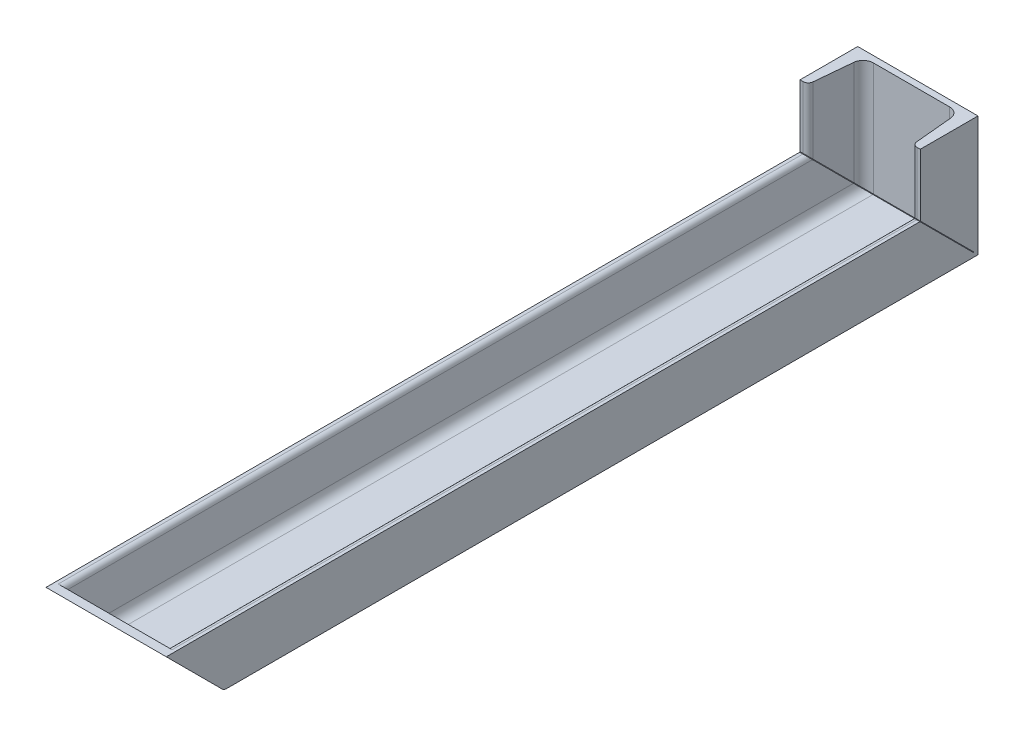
ISO-10303-21;
HEADER;
FILE_DESCRIPTION(('STEP AP214'),'2;1');
FILE_NAME('part.step','',(''),(''),'','','');
FILE_SCHEMA(('AUTOMOTIVE_DESIGN { 1 0 10303 214 1 1 1 1 }'));
ENDSEC;
DATA;
#1=APPLICATION_CONTEXT('core data for automotive mechanical design processes');
#2=APPLICATION_PROTOCOL_DEFINITION('international standard','automotive_design',2000,#1);
#3=PRODUCT_CONTEXT('',#1,'mechanical');
#4=PRODUCT('Part','Part','',(#3));
#5=PRODUCT_RELATED_PRODUCT_CATEGORY('part','',(#4));
#6=PRODUCT_DEFINITION_FORMATION('','',#4);
#7=PRODUCT_DEFINITION_CONTEXT('part definition',#1,'design');
#8=PRODUCT_DEFINITION('design','',#6,#7);
#9=PRODUCT_DEFINITION_SHAPE('','',#8);
#10=(LENGTH_UNIT() NAMED_UNIT(*) SI_UNIT(.MILLI.,.METRE.));
#11=(NAMED_UNIT(*) PLANE_ANGLE_UNIT() SI_UNIT($,.RADIAN.));
#12=(NAMED_UNIT(*) SI_UNIT($,.STERADIAN.) SOLID_ANGLE_UNIT());
#13=UNCERTAINTY_MEASURE_WITH_UNIT(LENGTH_MEASURE(1.E-05),#10,'distance_accuracy_value','');
#14=(GEOMETRIC_REPRESENTATION_CONTEXT(3) GLOBAL_UNCERTAINTY_ASSIGNED_CONTEXT((#13)) GLOBAL_UNIT_ASSIGNED_CONTEXT((#10,
#11,#12)) REPRESENTATION_CONTEXT('',''));
#15=CARTESIAN_POINT('',(0.,0.,0.));
#16=DIRECTION('',(0.,0.,1.));
#17=DIRECTION('',(1.,0.,0.));
#18=AXIS2_PLACEMENT_3D('',#15,#16,#17);
#19=CARTESIAN_POINT('',(-50.,48.,667.5));
#20=DIRECTION('',(1.,0.,0.));
#21=DIRECTION('',(0.,1.,0.));
#22=AXIS2_PLACEMENT_3D('',#19,#20,#21);
#23=PLANE('',#22);
#24=DIRECTION('',(0.,0.,-1.));
#25=VECTOR('',#24,1.);
#26=CARTESIAN_POINT('',(-50.,2.35922392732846E-13,667.5));
#27=LINE('',#26,#25);
#28=CARTESIAN_POINT('',(-50.,2.22044604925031E-13,624.924264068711));
#29=VERTEX_POINT('',#28);
#30=CARTESIAN_POINT('',(-50.,2.35922392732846E-13,0.));
#31=VERTEX_POINT('',#30);
#32=EDGE_CURVE('E403',#29,#31,#27,.T.);
#33=ORIENTED_EDGE('',*,*,#32,.F.);
#34=CARTESIAN_POINT('',(-50.,5.00000000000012,624.924264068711));
#35=DIRECTION('',(1.,0.,0.));
#36=DIRECTION('',(0.,1.,0.));
#37=AXIS2_PLACEMENT_3D('',#34,#35,#36);
#38=CIRCLE('',#37,5.);
#39=CARTESIAN_POINT('',(-50.,1.46446609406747,628.459797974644));
#40=VERTEX_POINT('',#39);
#41=EDGE_CURVE('E62',#29,#40,#38,.F.);
#42=ORIENTED_EDGE('',*,*,#41,.T.);
#43=DIRECTION('',(0.,0.707106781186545,0.70710678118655));
#44=VECTOR('',#43,1.);
#45=CARTESIAN_POINT('',(-50.,48.,674.995331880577));
#46=LINE('',#45,#44);
#47=CARTESIAN_POINT('',(-50.,48.,674.995331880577));
#48=VERTEX_POINT('',#47);
#49=EDGE_CURVE('E209',#40,#48,#46,.T.);
#50=ORIENTED_EDGE('',*,*,#49,.T.);
#51=DIRECTION('',(0.,0.,-1.));
#52=VECTOR('',#51,1.);
#53=CARTESIAN_POINT('',(-50.,48.,667.5));
#54=LINE('',#53,#52);
#55=CARTESIAN_POINT('',(-50.,48.0000000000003,48.2828427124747));
#56=VERTEX_POINT('',#55);
#57=EDGE_CURVE('E212',#48,#56,#54,.T.);
#58=ORIENTED_EDGE('',*,*,#57,.T.);
#59=DIRECTION('',(0.,0.707106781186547,0.707106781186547));
#60=VECTOR('',#59,1.);
#61=CARTESIAN_POINT('',(-50.,3.60624458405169,3.88908729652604));
#62=LINE('',#61,#60);
#63=CARTESIAN_POINT('',(-50.,3.60624458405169,3.88908729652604));
#64=VERTEX_POINT('',#63);
#65=EDGE_CURVE('E254',#64,#56,#62,.T.);
#66=ORIENTED_EDGE('',*,*,#65,.F.);
#67=DIRECTION('',(0.,-0.707106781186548,0.707106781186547));
#68=VECTOR('',#67,1.);
#69=CARTESIAN_POINT('',(-50.,3.88908729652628,3.6062445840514));
#70=LINE('',#69,#68);
#71=CARTESIAN_POINT('',(-50.,3.88908729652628,3.6062445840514));
#72=VERTEX_POINT('',#71);
#73=EDGE_CURVE('E251',#72,#64,#70,.T.);
#74=ORIENTED_EDGE('',*,*,#73,.F.);
#75=DIRECTION('',(0.,-0.707106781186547,-0.707106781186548));
#76=VECTOR('',#75,1.);
#77=CARTESIAN_POINT('',(-50.,50.3941347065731,50.1112919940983));
#78=LINE('',#77,#76);
#79=CARTESIAN_POINT('',(-50.,48.2828427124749,47.9999999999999));
#80=VERTEX_POINT('',#79);
#81=EDGE_CURVE('E249',#80,#72,#78,.T.);
#82=ORIENTED_EDGE('',*,*,#81,.F.);
#83=DIRECTION('',(0.,-1.,0.));
#84=VECTOR('',#83,1.);
#85=CARTESIAN_POINT('',(-50.,100.,48.));
#86=LINE('',#85,#84);
#87=CARTESIAN_POINT('',(-50.,100.,48.));
#88=VERTEX_POINT('',#87);
#89=EDGE_CURVE('E347',#88,#80,#86,.T.);
#90=ORIENTED_EDGE('',*,*,#89,.F.);
#91=DIRECTION('',(0.,0.,-1.));
#92=VECTOR('',#91,1.);
#93=CARTESIAN_POINT('',(-50.,100.,48.));
#94=LINE('',#93,#92);
#95=CARTESIAN_POINT('',(-50.,100.,0.));
#96=VERTEX_POINT('',#95);
#97=EDGE_CURVE('E310',#88,#96,#94,.T.);
#98=ORIENTED_EDGE('',*,*,#97,.T.);
#99=DIRECTION('',(0.,-1.,0.));
#100=VECTOR('',#99,1.);
#101=CARTESIAN_POINT('',(-50.,48.0000000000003,0.));
#102=LINE('',#101,#100);
#103=EDGE_CURVE('E350',#96,#31,#102,.T.);
#104=ORIENTED_EDGE('',*,*,#103,.T.);
#105=EDGE_LOOP('',(#33,#42,#50,#58,#66,#74,#82,#90,#98,#104));
#106=FACE_BOUND('',#105,.T.);
#107=ADVANCED_FACE('F41',(#106),#23,.F.);
#108=CARTESIAN_POINT('',(-50.,2.35922392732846E-13,667.5));
#109=DIRECTION('',(0.,1.,0.));
#110=DIRECTION('',(-1.,0.,0.));
#111=AXIS2_PLACEMENT_3D('',#108,#109,#110);
#112=PLANE('',#111);
#113=DIRECTION('',(0.,0.,-1.));
#114=VECTOR('',#113,1.);
#115=CARTESIAN_POINT('',(50.,2.35922392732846E-13,667.5));
#116=LINE('',#115,#114);
#117=CARTESIAN_POINT('',(50.,2.22044604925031E-13,624.924264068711));
#118=VERTEX_POINT('',#117);
#119=CARTESIAN_POINT('',(50.,2.35922392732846E-13,0.));
#120=VERTEX_POINT('',#119);
#121=EDGE_CURVE('E401',#118,#120,#116,.T.);
#122=ORIENTED_EDGE('',*,*,#121,.F.);
#123=DIRECTION('',(-1.,0.,0.));
#124=VECTOR('',#123,1.);
#125=CARTESIAN_POINT('',(-50.,2.22044604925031E-13,624.924264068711));
#126=LINE('',#125,#124);
#127=EDGE_CURVE('E408',#118,#29,#126,.T.);
#128=ORIENTED_EDGE('',*,*,#127,.T.);
#129=ORIENTED_EDGE('',*,*,#32,.T.);
#130=DIRECTION('',(1.,0.,0.));
#131=VECTOR('',#130,1.);
#132=CARTESIAN_POINT('',(-50.,2.35922392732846E-13,0.));
#133=LINE('',#132,#131);
#134=EDGE_CURVE('E379',#31,#120,#133,.T.);
#135=ORIENTED_EDGE('',*,*,#134,.T.);
#136=EDGE_LOOP('',(#122,#128,#129,#135));
#137=FACE_BOUND('',#136,.T.);
#138=ADVANCED_FACE('F414',(#137),#112,.F.);
#139=CARTESIAN_POINT('',(50.,2.35922392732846E-13,667.5));
#140=DIRECTION('',(-1.,0.,0.));
#141=DIRECTION('',(0.,-1.,0.));
#142=AXIS2_PLACEMENT_3D('',#139,#140,#141);
#143=PLANE('',#142);
#144=DIRECTION('',(0.,0.707106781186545,0.70710678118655));
#145=VECTOR('',#144,1.);
#146=CARTESIAN_POINT('',(50.,48.0000000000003,674.995331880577));
#147=LINE('',#146,#145);
#148=CARTESIAN_POINT('',(50.,1.46446609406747,628.459797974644));
#149=VERTEX_POINT('',#148);
#150=CARTESIAN_POINT('',(50.,48.0000000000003,674.995331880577));
#151=VERTEX_POINT('',#150);
#152=EDGE_CURVE('E214',#149,#151,#147,.T.);
#153=ORIENTED_EDGE('',*,*,#152,.F.);
#154=CARTESIAN_POINT('',(50.,5.00000000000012,624.924264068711));
#155=DIRECTION('',(-1.,0.,0.));
#156=DIRECTION('',(0.,-1.,0.));
#157=AXIS2_PLACEMENT_3D('',#154,#155,#156);
#158=CIRCLE('',#157,5.);
#159=EDGE_CURVE('E11',#149,#118,#158,.F.);
#160=ORIENTED_EDGE('',*,*,#159,.T.);
#161=ORIENTED_EDGE('',*,*,#121,.T.);
#162=DIRECTION('',(0.,1.,0.));
#163=VECTOR('',#162,1.);
#164=CARTESIAN_POINT('',(50.,2.35922392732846E-13,0.));
#165=LINE('',#164,#163);
#166=CARTESIAN_POINT('',(50.,100.,-1.11022302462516E-13));
#167=VERTEX_POINT('',#166);
#168=EDGE_CURVE('E225',#120,#167,#165,.T.);
#169=ORIENTED_EDGE('',*,*,#168,.T.);
#170=DIRECTION('',(0.,0.,1.));
#171=VECTOR('',#170,1.);
#172=CARTESIAN_POINT('',(50.,100.,-1.11022302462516E-13));
#173=LINE('',#172,#171);
#174=CARTESIAN_POINT('',(50.,100.,47.9999999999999));
#175=VERTEX_POINT('',#174);
#176=EDGE_CURVE('E316',#167,#175,#173,.T.);
#177=ORIENTED_EDGE('',*,*,#176,.T.);
#178=DIRECTION('',(0.,-1.,0.));
#179=VECTOR('',#178,1.);
#180=CARTESIAN_POINT('',(50.,100.,47.9999999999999));
#181=LINE('',#180,#179);
#182=CARTESIAN_POINT('',(50.,48.2828427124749,47.9999999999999));
#183=VERTEX_POINT('',#182);
#184=EDGE_CURVE('E346',#175,#183,#181,.T.);
#185=ORIENTED_EDGE('',*,*,#184,.T.);
#186=DIRECTION('',(0.,-0.707106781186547,-0.707106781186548));
#187=VECTOR('',#186,1.);
#188=CARTESIAN_POINT('',(50.,50.3941347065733,50.1112919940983));
#189=LINE('',#188,#187);
#190=CARTESIAN_POINT('',(50.,3.88908729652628,3.6062445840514));
#191=VERTEX_POINT('',#190);
#192=EDGE_CURVE('E256',#183,#191,#189,.T.);
#193=ORIENTED_EDGE('',*,*,#192,.T.);
#194=DIRECTION('',(0.,-0.707106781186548,0.707106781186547));
#195=VECTOR('',#194,1.);
#196=CARTESIAN_POINT('',(50.,3.88908729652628,3.6062445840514));
#197=LINE('',#196,#195);
#198=CARTESIAN_POINT('',(50.,3.60624458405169,3.88908729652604));
#199=VERTEX_POINT('',#198);
#200=EDGE_CURVE('E259',#191,#199,#197,.T.);
#201=ORIENTED_EDGE('',*,*,#200,.T.);
#202=DIRECTION('',(0.,0.707106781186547,0.707106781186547));
#203=VECTOR('',#202,1.);
#204=CARTESIAN_POINT('',(50.,3.60624458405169,3.88908729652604));
#205=LINE('',#204,#203);
#206=CARTESIAN_POINT('',(50.,48.0000000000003,48.2828427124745));
#207=VERTEX_POINT('',#206);
#208=EDGE_CURVE('E262',#199,#207,#205,.T.);
#209=ORIENTED_EDGE('',*,*,#208,.T.);
#210=DIRECTION('',(0.,0.,-1.));
#211=VECTOR('',#210,1.);
#212=CARTESIAN_POINT('',(50.,48.0000000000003,667.5));
#213=LINE('',#212,#211);
#214=EDGE_CURVE('E399',#151,#207,#213,.T.);
#215=ORIENTED_EDGE('',*,*,#214,.F.);
#216=EDGE_LOOP('',(#153,#160,#161,#169,#177,#185,#193,#201,#209,#215));
#217=FACE_BOUND('',#216,.T.);
#218=ADVANCED_FACE('F430',(#217),#143,.F.);
#219=CARTESIAN_POINT('',(47.3249453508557,43.8000000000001,667.5));
#220=DIRECTION('',(0.,0.,-1.));
#221=DIRECTION('',(-1.,0.,0.));
#222=AXIS2_PLACEMENT_3D('',#219,#220,#221);
#223=CYLINDRICAL_SURFACE('',#222,4.2);
#224=DIRECTION('',(0.,0.,-1.));
#225=VECTOR('',#224,1.);
#226=CARTESIAN_POINT('',(43.1432531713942,44.1917276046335,667.5));
#227=LINE('',#226,#225);
#228=CARTESIAN_POINT('',(43.1432531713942,44.1917276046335,663.691727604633));
#229=VERTEX_POINT('',#228);
#230=CARTESIAN_POINT('',(43.1432531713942,44.1917276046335,44.4745703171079));
#231=VERTEX_POINT('',#230);
#232=EDGE_CURVE('E394',#229,#231,#227,.T.);
#233=ORIENTED_EDGE('',*,*,#232,.F.);
#234=CARTESIAN_POINT('',(47.3249453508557,43.8000000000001,663.3));
#235=DIRECTION('',(0.,0.707106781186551,-0.707106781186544));
#236=DIRECTION('',(0.,-0.707106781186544,-0.707106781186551));
#237=AXIS2_PLACEMENT_3D('',#234,#235,#236);
#238=ELLIPSE('',#237,5.93969696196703,4.2);
#239=CARTESIAN_POINT('',(47.3249453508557,48.0000000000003,667.5));
#240=VERTEX_POINT('',#239);
#241=EDGE_CURVE('E247',#229,#240,#238,.T.);
#242=ORIENTED_EDGE('',*,*,#241,.T.);
#243=DIRECTION('',(0.,0.,-1.));
#244=VECTOR('',#243,1.);
#245=CARTESIAN_POINT('',(47.3249453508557,48.0000000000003,667.5));
#246=LINE('',#245,#244);
#247=CARTESIAN_POINT('',(47.3249453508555,48.0000000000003,48.2828427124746));
#248=VERTEX_POINT('',#247);
#249=EDGE_CURVE('E396',#240,#248,#246,.T.);
#250=ORIENTED_EDGE('',*,*,#249,.T.);
#251=CARTESIAN_POINT('',(47.3249453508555,43.8000000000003,44.0828427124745));
#252=DIRECTION('',(0.,-0.707106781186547,0.707106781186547));
#253=DIRECTION('',(0.,-0.707106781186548,-0.707106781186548));
#254=AXIS2_PLACEMENT_3D('',#251,#252,#253);
#255=ELLIPSE('',#254,5.93969696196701,4.2);
#256=EDGE_CURVE('E304',#248,#231,#255,.T.);
#257=ORIENTED_EDGE('',*,*,#256,.T.);
#258=EDGE_LOOP('',(#233,#242,#250,#257));
#259=FACE_BOUND('',#258,.T.);
#260=ADVANCED_FACE('F447',(#259),#223,.T.);
#261=CARTESIAN_POINT('',(43.1432531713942,44.1917276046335,667.5));
#262=DIRECTION('',(0.995640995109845,-0.0932684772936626,0.));
#263=DIRECTION('',(0.0932684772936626,0.995640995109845,0.));
#264=AXIS2_PLACEMENT_3D('',#261,#262,#263);
#265=PLANE('',#264);
#266=DIRECTION('',(0.,0.,-1.));
#267=VECTOR('',#266,1.);
#268=CARTESIAN_POINT('',(40.2219876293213,13.0072179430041,667.5));
#269=LINE('',#268,#267);
#270=CARTESIAN_POINT('',(40.2219876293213,13.0072179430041,632.507217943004));
#271=VERTEX_POINT('',#270);
#272=CARTESIAN_POINT('',(40.2219876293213,13.0072179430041,13.2900606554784));
#273=VERTEX_POINT('',#272);
#274=EDGE_CURVE('E392',#271,#273,#269,.T.);
#275=ORIENTED_EDGE('',*,*,#274,.F.);
#276=DIRECTION('',(0.0660946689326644,0.70556059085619,0.705560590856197));
#277=VECTOR('',#276,1.);
#278=CARTESIAN_POINT('',(43.3208473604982,46.087545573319,665.587545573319));
#279=LINE('',#278,#277);
#280=EDGE_CURVE('E245',#271,#229,#279,.T.);
#281=ORIENTED_EDGE('',*,*,#280,.T.);
#282=ORIENTED_EDGE('',*,*,#232,.T.);
#283=DIRECTION('',(-0.0660946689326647,-0.705560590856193,-0.705560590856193));
#284=VECTOR('',#283,1.);
#285=CARTESIAN_POINT('',(72.1972925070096,354.343597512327,354.626440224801));
#286=LINE('',#285,#284);
#287=EDGE_CURVE('E301',#231,#273,#286,.T.);
#288=ORIENTED_EDGE('',*,*,#287,.T.);
#289=EDGE_LOOP('',(#275,#281,#282,#288));
#290=FACE_BOUND('',#289,.T.);
#291=ADVANCED_FACE('F452',(#290),#265,.F.);
#292=CARTESIAN_POINT('',(31.7590391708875,13.8000000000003,667.5));
#293=DIRECTION('',(0.,0.,-1.));
#294=DIRECTION('',(-1.,0.,0.));
#295=AXIS2_PLACEMENT_3D('',#292,#293,#294);
#296=CYLINDRICAL_SURFACE('',#295,8.5);
#297=DIRECTION('',(0.,0.,-1.));
#298=VECTOR('',#297,1.);
#299=CARTESIAN_POINT('',(31.7590391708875,5.3000000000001,667.5));
#300=LINE('',#299,#298);
#301=CARTESIAN_POINT('',(31.7590391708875,5.3000000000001,624.8));
#302=VERTEX_POINT('',#301);
#303=CARTESIAN_POINT('',(31.7590391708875,5.30000000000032,5.5828427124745));
#304=VERTEX_POINT('',#303);
#305=EDGE_CURVE('E390',#302,#304,#300,.T.);
#306=ORIENTED_EDGE('',*,*,#305,.F.);
#307=CARTESIAN_POINT('',(31.7590391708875,13.8000000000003,633.3));
#308=DIRECTION('',(0.,0.707106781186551,-0.707106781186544));
#309=DIRECTION('',(0.,-0.707106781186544,-0.707106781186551));
#310=AXIS2_PLACEMENT_3D('',#307,#308,#309);
#311=ELLIPSE('',#310,12.0208152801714,8.5);
#312=EDGE_CURVE('E243',#302,#271,#311,.F.);
#313=ORIENTED_EDGE('',*,*,#312,.T.);
#314=ORIENTED_EDGE('',*,*,#274,.T.);
#315=CARTESIAN_POINT('',(31.7590391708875,13.8000000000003,14.0828427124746));
#316=DIRECTION('',(0.,-0.707106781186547,0.707106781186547));
#317=DIRECTION('',(0.,-0.707106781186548,-0.707106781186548));
#318=AXIS2_PLACEMENT_3D('',#315,#316,#317);
#319=ELLIPSE('',#318,12.0208152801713,8.5);
#320=EDGE_CURVE('E298',#273,#304,#319,.F.);
#321=ORIENTED_EDGE('',*,*,#320,.T.);
#322=EDGE_LOOP('',(#306,#313,#314,#321));
#323=FACE_BOUND('',#322,.T.);
#324=ADVANCED_FACE('F456',(#323),#296,.F.);
#325=CARTESIAN_POINT('',(31.7590391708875,5.3000000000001,667.5));
#326=DIRECTION('',(0.,-1.,0.));
#327=DIRECTION('',(1.,0.,0.));
#328=AXIS2_PLACEMENT_3D('',#325,#326,#327);
#329=PLANE('',#328);
#330=DIRECTION('',(0.,0.,-1.));
#331=VECTOR('',#330,1.);
#332=CARTESIAN_POINT('',(-31.7590391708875,5.30000000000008,667.5));
#333=LINE('',#332,#331);
#334=CARTESIAN_POINT('',(-31.7590391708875,5.3000000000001,624.8));
#335=VERTEX_POINT('',#334);
#336=CARTESIAN_POINT('',(-31.7590391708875,5.30000000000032,5.5828427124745));
#337=VERTEX_POINT('',#336);
#338=EDGE_CURVE('E388',#335,#337,#333,.T.);
#339=ORIENTED_EDGE('',*,*,#338,.F.);
#340=DIRECTION('',(1.,0.,0.));
#341=VECTOR('',#340,1.);
#342=CARTESIAN_POINT('',(31.7590391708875,5.3000000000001,624.8));
#343=LINE('',#342,#341);
#344=EDGE_CURVE('E241',#335,#302,#343,.T.);
#345=ORIENTED_EDGE('',*,*,#344,.T.);
#346=ORIENTED_EDGE('',*,*,#305,.T.);
#347=DIRECTION('',(-1.,0.,0.));
#348=VECTOR('',#347,1.);
#349=CARTESIAN_POINT('',(31.7590391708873,5.30000000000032,5.5828427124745));
#350=LINE('',#349,#348);
#351=EDGE_CURVE('E295',#304,#337,#350,.T.);
#352=ORIENTED_EDGE('',*,*,#351,.T.);
#353=EDGE_LOOP('',(#339,#345,#346,#352));
#354=FACE_BOUND('',#353,.T.);
#355=ADVANCED_FACE('F460',(#354),#329,.F.);
#356=CARTESIAN_POINT('',(-31.7590391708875,13.8,667.5));
#357=DIRECTION('',(0.,0.,-1.));
#358=DIRECTION('',(-1.,0.,0.));
#359=AXIS2_PLACEMENT_3D('',#356,#357,#358);
#360=CYLINDRICAL_SURFACE('',#359,8.5);
#361=DIRECTION('',(0.,0.,-1.));
#362=VECTOR('',#361,1.);
#363=CARTESIAN_POINT('',(-40.2219876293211,13.0072179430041,667.5));
#364=LINE('',#363,#362);
#365=CARTESIAN_POINT('',(-40.2219876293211,13.0072179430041,632.507217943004));
#366=VERTEX_POINT('',#365);
#367=CARTESIAN_POINT('',(-40.2219876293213,13.0072179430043,13.2900606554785));
#368=VERTEX_POINT('',#367);
#369=EDGE_CURVE('E386',#366,#368,#364,.T.);
#370=ORIENTED_EDGE('',*,*,#369,.F.);
#371=CARTESIAN_POINT('',(-31.7590391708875,13.8000000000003,633.3));
#372=DIRECTION('',(0.,0.707106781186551,-0.707106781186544));
#373=DIRECTION('',(0.,-0.707106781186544,-0.707106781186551));
#374=AXIS2_PLACEMENT_3D('',#371,#372,#373);
#375=ELLIPSE('',#374,12.0208152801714,8.5);
#376=EDGE_CURVE('E239',#366,#335,#375,.F.);
#377=ORIENTED_EDGE('',*,*,#376,.T.);
#378=ORIENTED_EDGE('',*,*,#338,.T.);
#379=CARTESIAN_POINT('',(-31.7590391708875,13.8000000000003,14.0828427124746));
#380=DIRECTION('',(0.,-0.707106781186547,0.707106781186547));
#381=DIRECTION('',(0.,-0.707106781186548,-0.707106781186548));
#382=AXIS2_PLACEMENT_3D('',#379,#380,#381);
#383=ELLIPSE('',#382,12.0208152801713,8.5);
#384=EDGE_CURVE('E292',#337,#368,#383,.F.);
#385=ORIENTED_EDGE('',*,*,#384,.T.);
#386=EDGE_LOOP('',(#370,#377,#378,#385));
#387=FACE_BOUND('',#386,.T.);
#388=ADVANCED_FACE('F464',(#387),#360,.F.);
#389=CARTESIAN_POINT('',(-40.2219876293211,13.0072179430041,667.5));
#390=DIRECTION('',(-0.995640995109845,-0.0932684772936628,0.));
#391=DIRECTION('',(0.0932684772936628,-0.995640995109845,0.));
#392=AXIS2_PLACEMENT_3D('',#389,#390,#391);
#393=PLANE('',#392);
#394=DIRECTION('',(0.,0.,-1.));
#395=VECTOR('',#394,1.);
#396=CARTESIAN_POINT('',(-43.1432531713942,44.1917276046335,667.5));
#397=LINE('',#396,#395);
#398=CARTESIAN_POINT('',(-43.1432531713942,44.1917276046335,663.691727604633));
#399=VERTEX_POINT('',#398);
#400=CARTESIAN_POINT('',(-43.1432531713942,44.1917276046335,44.4745703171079));
#401=VERTEX_POINT('',#400);
#402=EDGE_CURVE('E384',#399,#401,#397,.T.);
#403=ORIENTED_EDGE('',*,*,#402,.F.);
#404=DIRECTION('',(0.0660946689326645,-0.70556059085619,-0.705560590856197));
#405=VECTOR('',#404,1.);
#406=CARTESIAN_POINT('',(-41.8538338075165,30.4271758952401,649.92717589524));
#407=LINE('',#406,#405);
#408=EDGE_CURVE('E237',#399,#366,#407,.T.);
#409=ORIENTED_EDGE('',*,*,#408,.T.);
#410=ORIENTED_EDGE('',*,*,#369,.T.);
#411=DIRECTION('',(-0.0660946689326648,0.705560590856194,0.705560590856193));
#412=VECTOR('',#411,1.);
#413=CARTESIAN_POINT('',(-70.7302789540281,338.683227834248,338.966070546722));
#414=LINE('',#413,#412);
#415=EDGE_CURVE('E289',#368,#401,#414,.T.);
#416=ORIENTED_EDGE('',*,*,#415,.T.);
#417=EDGE_LOOP('',(#403,#409,#410,#416));
#418=FACE_BOUND('',#417,.T.);
#419=ADVANCED_FACE('F468',(#418),#393,.F.);
#420=CARTESIAN_POINT('',(-47.3249453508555,43.8000000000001,667.5));
#421=DIRECTION('',(0.,0.,-1.));
#422=DIRECTION('',(-1.,0.,0.));
#423=AXIS2_PLACEMENT_3D('',#420,#421,#422);
#424=CYLINDRICAL_SURFACE('',#423,4.2);
#425=DIRECTION('',(0.,0.,-1.));
#426=VECTOR('',#425,1.);
#427=CARTESIAN_POINT('',(-47.3249453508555,48.,667.5));
#428=LINE('',#427,#426);
#429=CARTESIAN_POINT('',(-47.3249453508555,48.,667.5));
#430=VERTEX_POINT('',#429);
#431=CARTESIAN_POINT('',(-47.3249453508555,48.0000000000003,48.2828427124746));
#432=VERTEX_POINT('',#431);
#433=EDGE_CURVE('E224',#430,#432,#428,.T.);
#434=ORIENTED_EDGE('',*,*,#433,.F.);
#435=CARTESIAN_POINT('',(-47.3249453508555,43.8000000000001,663.3));
#436=DIRECTION('',(0.,0.707106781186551,-0.707106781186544));
#437=DIRECTION('',(0.,-0.707106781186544,-0.707106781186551));
#438=AXIS2_PLACEMENT_3D('',#435,#436,#437);
#439=ELLIPSE('',#438,5.93969696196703,4.2);
#440=EDGE_CURVE('E232',#430,#399,#439,.T.);
#441=ORIENTED_EDGE('',*,*,#440,.T.);
#442=ORIENTED_EDGE('',*,*,#402,.T.);
#443=CARTESIAN_POINT('',(-47.3249453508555,43.8000000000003,44.0828427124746));
#444=DIRECTION('',(0.,-0.707106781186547,0.707106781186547));
#445=DIRECTION('',(0.,-0.707106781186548,-0.707106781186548));
#446=AXIS2_PLACEMENT_3D('',#443,#444,#445);
#447=ELLIPSE('',#446,5.939696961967,4.2);
#448=EDGE_CURVE('E286',#401,#432,#447,.T.);
#449=ORIENTED_EDGE('',*,*,#448,.T.);
#450=EDGE_LOOP('',(#434,#441,#442,#449));
#451=FACE_BOUND('',#450,.T.);
#452=ADVANCED_FACE('F472',(#451),#424,.T.);
#453=CARTESIAN_POINT('',(-47.3249453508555,48.,667.5));
#454=DIRECTION('',(0.,-1.,0.));
#455=DIRECTION('',(0.,0.,-1.));
#456=AXIS2_PLACEMENT_3D('',#453,#454,#455);
#457=PLANE('',#456);
#458=ORIENTED_EDGE('',*,*,#433,.T.);
#459=DIRECTION('',(-1.,0.,0.));
#460=VECTOR('',#459,1.);
#461=CARTESIAN_POINT('',(-47.3249453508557,48.0000000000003,48.2828427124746));
#462=LINE('',#461,#460);
#463=EDGE_CURVE('E223',#432,#56,#462,.T.);
#464=ORIENTED_EDGE('',*,*,#463,.T.);
#465=ORIENTED_EDGE('',*,*,#57,.F.);
#466=DIRECTION('',(-1.,0.,0.));
#467=VECTOR('',#466,1.);
#468=CARTESIAN_POINT('',(50.,48.0000000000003,674.995331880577));
#469=LINE('',#468,#467);
#470=EDGE_CURVE('E222',#151,#48,#469,.T.);
#471=ORIENTED_EDGE('',*,*,#470,.F.);
#472=ORIENTED_EDGE('',*,*,#214,.T.);
#473=DIRECTION('',(-1.,0.,0.));
#474=VECTOR('',#473,1.);
#475=CARTESIAN_POINT('',(49.9999999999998,48.0000000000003,48.2828427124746));
#476=LINE('',#475,#474);
#477=EDGE_CURVE('E307',#207,#248,#476,.T.);
#478=ORIENTED_EDGE('',*,*,#477,.T.);
#479=ORIENTED_EDGE('',*,*,#249,.F.);
#480=DIRECTION('',(-1.,0.,0.));
#481=VECTOR('',#480,1.);
#482=CARTESIAN_POINT('',(50.,48.0000000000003,667.5));
#483=LINE('',#482,#481);
#484=EDGE_CURVE('E229',#240,#430,#483,.T.);
#485=ORIENTED_EDGE('',*,*,#484,.T.);
#486=EDGE_LOOP('',(#458,#464,#465,#471,#472,#478,#479,#485));
#487=FACE_BOUND('',#486,.T.);
#488=ADVANCED_FACE('F220',(#487),#457,.F.);
#489=CARTESIAN_POINT('',(47.3249453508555,43.8000000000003,0.));
#490=DIRECTION('',(0.,0.,1.));
#491=DIRECTION('',(1.,0.,0.));
#492=AXIS2_PLACEMENT_3D('',#489,#490,#491);
#493=PLANE('',#492);
#494=ORIENTED_EDGE('',*,*,#103,.F.);
#495=DIRECTION('',(1.,0.,0.));
#496=VECTOR('',#495,1.);
#497=CARTESIAN_POINT('',(-50.,100.,0.));
#498=LINE('',#497,#496);
#499=EDGE_CURVE('E313',#96,#167,#498,.T.);
#500=ORIENTED_EDGE('',*,*,#499,.T.);
#501=ORIENTED_EDGE('',*,*,#168,.F.);
#502=ORIENTED_EDGE('',*,*,#134,.F.);
#503=EDGE_LOOP('',(#494,#500,#501,#502));
#504=FACE_BOUND('',#503,.T.);
#505=ADVANCED_FACE('F421',(#504),#493,.F.);
#506=CARTESIAN_POINT('',(50.,100.,47.9999999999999));
#507=DIRECTION('',(0.,0.,1.));
#508=DIRECTION('',(1.,0.,0.));
#509=AXIS2_PLACEMENT_3D('',#506,#507,#508);
#510=PLANE('',#509);
#511=DIRECTION('',(-1.,0.,0.));
#512=VECTOR('',#511,1.);
#513=CARTESIAN_POINT('',(50.,48.2828427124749,47.9999999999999));
#514=LINE('',#513,#512);
#515=CARTESIAN_POINT('',(47.3249453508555,48.2828427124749,47.9999999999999));
#516=VERTEX_POINT('',#515);
#517=EDGE_CURVE('E284',#183,#516,#514,.T.);
#518=ORIENTED_EDGE('',*,*,#517,.F.);
#519=ORIENTED_EDGE('',*,*,#184,.F.);
#520=DIRECTION('',(-1.,0.,0.));
#521=VECTOR('',#520,1.);
#522=CARTESIAN_POINT('',(50.,100.,47.9999999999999));
#523=LINE('',#522,#521);
#524=CARTESIAN_POINT('',(47.3249453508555,100.,47.9999999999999));
#525=VERTEX_POINT('',#524);
#526=EDGE_CURVE('E319',#175,#525,#523,.T.);
#527=ORIENTED_EDGE('',*,*,#526,.T.);
#528=DIRECTION('',(0.,-1.,0.));
#529=VECTOR('',#528,1.);
#530=CARTESIAN_POINT('',(47.3249453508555,100.,47.9999999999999));
#531=LINE('',#530,#529);
#532=EDGE_CURVE('E372',#525,#516,#531,.T.);
#533=ORIENTED_EDGE('',*,*,#532,.T.);
#534=EDGE_LOOP('',(#518,#519,#527,#533));
#535=FACE_BOUND('',#534,.T.);
#536=ADVANCED_FACE('F481',(#535),#510,.T.);
#537=CARTESIAN_POINT('',(47.3249453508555,100.,43.7999999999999));
#538=DIRECTION('',(0.,-1.,0.));
#539=DIRECTION('',(1.,0.,0.));
#540=AXIS2_PLACEMENT_3D('',#537,#538,#539);
#541=CYLINDRICAL_SURFACE('',#540,4.2);
#542=CARTESIAN_POINT('',(47.3249453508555,44.0828427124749,43.7999999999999));
#543=DIRECTION('',(0.,0.707106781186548,-0.707106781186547));
#544=DIRECTION('',(0.,-0.707106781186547,-0.707106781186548));
#545=AXIS2_PLACEMENT_3D('',#542,#543,#544);
#546=ELLIPSE('',#545,5.939696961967,4.2);
#547=CARTESIAN_POINT('',(43.1432531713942,44.4745703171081,44.1917276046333));
#548=VERTEX_POINT('',#547);
#549=EDGE_CURVE('E282',#516,#548,#546,.F.);
#550=ORIENTED_EDGE('',*,*,#549,.F.);
#551=ORIENTED_EDGE('',*,*,#532,.F.);
#552=CARTESIAN_POINT('',(47.3249453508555,100.,43.7999999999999));
#553=DIRECTION('',(0.,-1.,0.));
#554=DIRECTION('',(1.,0.,0.));
#555=AXIS2_PLACEMENT_3D('',#552,#553,#554);
#556=CIRCLE('',#555,4.2);
#557=CARTESIAN_POINT('',(43.1432531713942,100.,44.1917276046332));
#558=VERTEX_POINT('',#557);
#559=EDGE_CURVE('E322',#525,#558,#556,.T.);
#560=ORIENTED_EDGE('',*,*,#559,.T.);
#561=DIRECTION('',(0.,-1.,0.));
#562=VECTOR('',#561,1.);
#563=CARTESIAN_POINT('',(43.1432531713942,100.,44.1917276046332));
#564=LINE('',#563,#562);
#565=EDGE_CURVE('E369',#558,#548,#564,.T.);
#566=ORIENTED_EDGE('',*,*,#565,.T.);
#567=EDGE_LOOP('',(#550,#551,#560,#566));
#568=FACE_BOUND('',#567,.T.);
#569=ADVANCED_FACE('F484',(#568),#541,.T.);
#570=CARTESIAN_POINT('',(43.1432531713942,100.,44.1917276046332));
#571=DIRECTION('',(-0.995640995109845,0.,0.0932684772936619));
#572=DIRECTION('',(0.0932684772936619,0.,0.995640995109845));
#573=AXIS2_PLACEMENT_3D('',#570,#571,#572);
#574=PLANE('',#573);
#575=DIRECTION('',(-0.0660946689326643,-0.705560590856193,-0.705560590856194));
#576=VECTOR('',#575,1.);
#577=CARTESIAN_POINT('',(45.7326146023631,72.1160035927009,71.833160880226));
#578=LINE('',#577,#576);
#579=CARTESIAN_POINT('',(40.2219876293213,13.2900606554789,13.0072179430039));
#580=VERTEX_POINT('',#579);
#581=EDGE_CURVE('E280',#548,#580,#578,.T.);
#582=ORIENTED_EDGE('',*,*,#581,.F.);
#583=ORIENTED_EDGE('',*,*,#565,.F.);
#584=DIRECTION('',(-0.0932684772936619,0.,-0.995640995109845));
#585=VECTOR('',#584,1.);
#586=CARTESIAN_POINT('',(43.1432531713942,100.,44.1917276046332));
#587=LINE('',#586,#585);
#588=CARTESIAN_POINT('',(40.2219876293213,100.,13.0072179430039));
#589=VERTEX_POINT('',#588);
#590=EDGE_CURVE('E325',#558,#589,#587,.T.);
#591=ORIENTED_EDGE('',*,*,#590,.T.);
#592=DIRECTION('',(0.,-1.,0.));
#593=VECTOR('',#592,1.);
#594=CARTESIAN_POINT('',(40.2219876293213,100.,13.0072179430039));
#595=LINE('',#594,#593);
#596=EDGE_CURVE('E366',#589,#580,#595,.T.);
#597=ORIENTED_EDGE('',*,*,#596,.T.);
#598=EDGE_LOOP('',(#582,#583,#591,#597));
#599=FACE_BOUND('',#598,.T.);
#600=ADVANCED_FACE('F488',(#599),#574,.T.);
#601=CARTESIAN_POINT('',(31.7590391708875,100.,13.7999999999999));
#602=DIRECTION('',(0.,-1.,0.));
#603=DIRECTION('',(1.,0.,0.));
#604=AXIS2_PLACEMENT_3D('',#601,#602,#603);
#605=CYLINDRICAL_SURFACE('',#604,8.5);
#606=CARTESIAN_POINT('',(31.7590391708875,14.0828427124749,13.7999999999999));
#607=DIRECTION('',(0.,0.707106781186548,-0.707106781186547));
#608=DIRECTION('',(0.,-0.707106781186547,-0.707106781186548));
#609=AXIS2_PLACEMENT_3D('',#606,#607,#608);
#610=ELLIPSE('',#609,12.0208152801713,8.5);
#611=CARTESIAN_POINT('',(31.7590391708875,5.5828427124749,5.29999999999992));
#612=VERTEX_POINT('',#611);
#613=EDGE_CURVE('E278',#580,#612,#610,.T.);
#614=ORIENTED_EDGE('',*,*,#613,.F.);
#615=ORIENTED_EDGE('',*,*,#596,.F.);
#616=CARTESIAN_POINT('',(31.7590391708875,100.,13.7999999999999));
#617=DIRECTION('',(0.,1.,0.));
#618=DIRECTION('',(-1.,0.,0.));
#619=AXIS2_PLACEMENT_3D('',#616,#617,#618);
#620=CIRCLE('',#619,8.5);
#621=CARTESIAN_POINT('',(31.7590391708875,100.,5.29999999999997));
#622=VERTEX_POINT('',#621);
#623=EDGE_CURVE('E328',#589,#622,#620,.T.);
#624=ORIENTED_EDGE('',*,*,#623,.T.);
#625=DIRECTION('',(0.,-1.,0.));
#626=VECTOR('',#625,1.);
#627=CARTESIAN_POINT('',(31.7590391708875,100.,5.29999999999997));
#628=LINE('',#627,#626);
#629=EDGE_CURVE('E363',#622,#612,#628,.T.);
#630=ORIENTED_EDGE('',*,*,#629,.T.);
#631=EDGE_LOOP('',(#614,#615,#624,#630));
#632=FACE_BOUND('',#631,.T.);
#633=ADVANCED_FACE('F492',(#632),#605,.F.);
#634=CARTESIAN_POINT('',(31.7590391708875,100.,5.29999999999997));
#635=DIRECTION('',(0.,0.,1.));
#636=DIRECTION('',(1.,0.,0.));
#637=AXIS2_PLACEMENT_3D('',#634,#635,#636);
#638=PLANE('',#637);
#639=DIRECTION('',(-1.,0.,0.));
#640=VECTOR('',#639,1.);
#641=CARTESIAN_POINT('',(31.7590391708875,5.5828427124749,5.29999999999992));
#642=LINE('',#641,#640);
#643=CARTESIAN_POINT('',(-31.7590391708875,5.5828427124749,5.29999999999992));
#644=VERTEX_POINT('',#643);
#645=EDGE_CURVE('E276',#612,#644,#642,.T.);
#646=ORIENTED_EDGE('',*,*,#645,.F.);
#647=ORIENTED_EDGE('',*,*,#629,.F.);
#648=DIRECTION('',(-1.,0.,0.));
#649=VECTOR('',#648,1.);
#650=CARTESIAN_POINT('',(31.7590391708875,100.,5.29999999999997));
#651=LINE('',#650,#649);
#652=CARTESIAN_POINT('',(-31.7590391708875,100.,5.29999999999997));
#653=VERTEX_POINT('',#652);
#654=EDGE_CURVE('E331',#622,#653,#651,.T.);
#655=ORIENTED_EDGE('',*,*,#654,.T.);
#656=DIRECTION('',(0.,-1.,0.));
#657=VECTOR('',#656,1.);
#658=CARTESIAN_POINT('',(-31.7590391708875,100.,5.29999999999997));
#659=LINE('',#658,#657);
#660=EDGE_CURVE('E360',#653,#644,#659,.T.);
#661=ORIENTED_EDGE('',*,*,#660,.T.);
#662=EDGE_LOOP('',(#646,#647,#655,#661));
#663=FACE_BOUND('',#662,.T.);
#664=ADVANCED_FACE('F496',(#663),#638,.T.);
#665=CARTESIAN_POINT('',(-31.7590391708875,100.,13.8));
#666=DIRECTION('',(0.,-1.,0.));
#667=DIRECTION('',(1.,0.,0.));
#668=AXIS2_PLACEMENT_3D('',#665,#666,#667);
#669=CYLINDRICAL_SURFACE('',#668,8.5);
#670=CARTESIAN_POINT('',(-31.7590391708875,14.0828427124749,13.7999999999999));
#671=DIRECTION('',(0.,0.707106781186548,-0.707106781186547));
#672=DIRECTION('',(0.,-0.707106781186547,-0.707106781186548));
#673=AXIS2_PLACEMENT_3D('',#670,#671,#672);
#674=ELLIPSE('',#673,12.0208152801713,8.5);
#675=CARTESIAN_POINT('',(-40.2219876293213,13.2900606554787,13.0072179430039));
#676=VERTEX_POINT('',#675);
#677=EDGE_CURVE('E274',#644,#676,#674,.T.);
#678=ORIENTED_EDGE('',*,*,#677,.F.);
#679=ORIENTED_EDGE('',*,*,#660,.F.);
#680=CARTESIAN_POINT('',(-31.7590391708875,100.,13.8));
#681=DIRECTION('',(0.,1.,0.));
#682=DIRECTION('',(-1.,0.,0.));
#683=AXIS2_PLACEMENT_3D('',#680,#681,#682);
#684=CIRCLE('',#683,8.5);
#685=CARTESIAN_POINT('',(-40.2219876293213,100.,13.0072179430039));
#686=VERTEX_POINT('',#685);
#687=EDGE_CURVE('E334',#653,#686,#684,.T.);
#688=ORIENTED_EDGE('',*,*,#687,.T.);
#689=DIRECTION('',(0.,-1.,0.));
#690=VECTOR('',#689,1.);
#691=CARTESIAN_POINT('',(-40.2219876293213,100.,13.0072179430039));
#692=LINE('',#691,#690);
#693=EDGE_CURVE('E357',#686,#676,#692,.T.);
#694=ORIENTED_EDGE('',*,*,#693,.T.);
#695=EDGE_LOOP('',(#678,#679,#688,#694));
#696=FACE_BOUND('',#695,.T.);
#697=ADVANCED_FACE('F500',(#696),#669,.F.);
#698=CARTESIAN_POINT('',(-40.2219876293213,100.,13.0072179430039));
#699=DIRECTION('',(0.995640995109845,0.,0.0932684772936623));
#700=DIRECTION('',(0.0932684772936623,0.,-0.995640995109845));
#701=AXIS2_PLACEMENT_3D('',#698,#699,#700);
#702=PLANE('',#701);
#703=DIRECTION('',(-0.0660946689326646,0.705560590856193,0.705560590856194));
#704=VECTOR('',#703,1.);
#705=CARTESIAN_POINT('',(-44.2656010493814,56.4556339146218,56.172791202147));
#706=LINE('',#705,#704);
#707=CARTESIAN_POINT('',(-43.1432531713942,44.4745703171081,44.1917276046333));
#708=VERTEX_POINT('',#707);
#709=EDGE_CURVE('E272',#676,#708,#706,.T.);
#710=ORIENTED_EDGE('',*,*,#709,.F.);
#711=ORIENTED_EDGE('',*,*,#693,.F.);
#712=DIRECTION('',(-0.0932684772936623,0.,0.995640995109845));
#713=VECTOR('',#712,1.);
#714=CARTESIAN_POINT('',(-40.2219876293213,100.,13.0072179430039));
#715=LINE('',#714,#713);
#716=CARTESIAN_POINT('',(-43.1432531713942,100.,44.1917276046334));
#717=VERTEX_POINT('',#716);
#718=EDGE_CURVE('E337',#686,#717,#715,.T.);
#719=ORIENTED_EDGE('',*,*,#718,.T.);
#720=DIRECTION('',(0.,-1.,0.));
#721=VECTOR('',#720,1.);
#722=CARTESIAN_POINT('',(-43.1432531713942,100.,44.1917276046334));
#723=LINE('',#722,#721);
#724=EDGE_CURVE('E354',#717,#708,#723,.T.);
#725=ORIENTED_EDGE('',*,*,#724,.T.);
#726=EDGE_LOOP('',(#710,#711,#719,#725));
#727=FACE_BOUND('',#726,.T.);
#728=ADVANCED_FACE('F504',(#727),#702,.T.);
#729=CARTESIAN_POINT('',(-47.3249453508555,100.,48.));
#730=DIRECTION('',(0.,0.,1.));
#731=DIRECTION('',(1.,0.,0.));
#732=AXIS2_PLACEMENT_3D('',#729,#730,#731);
#733=PLANE('',#732);
#734=DIRECTION('',(-1.,0.,0.));
#735=VECTOR('',#734,1.);
#736=CARTESIAN_POINT('',(-47.3249453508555,48.2828427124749,47.9999999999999));
#737=LINE('',#736,#735);
#738=CARTESIAN_POINT('',(-47.3249453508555,48.2828427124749,47.9999999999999));
#739=VERTEX_POINT('',#738);
#740=EDGE_CURVE('E268',#739,#80,#737,.T.);
#741=ORIENTED_EDGE('',*,*,#740,.F.);
#742=DIRECTION('',(0.,-1.,0.));
#743=VECTOR('',#742,1.);
#744=CARTESIAN_POINT('',(-47.3249453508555,100.,48.));
#745=LINE('',#744,#743);
#746=CARTESIAN_POINT('',(-47.3249453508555,100.,48.));
#747=VERTEX_POINT('',#746);
#748=EDGE_CURVE('E351',#747,#739,#745,.T.);
#749=ORIENTED_EDGE('',*,*,#748,.F.);
#750=DIRECTION('',(-1.,0.,0.));
#751=VECTOR('',#750,1.);
#752=CARTESIAN_POINT('',(-47.3249453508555,100.,48.));
#753=LINE('',#752,#751);
#754=EDGE_CURVE('E343',#747,#88,#753,.T.);
#755=ORIENTED_EDGE('',*,*,#754,.T.);
#756=ORIENTED_EDGE('',*,*,#89,.T.);
#757=EDGE_LOOP('',(#741,#749,#755,#756));
#758=FACE_BOUND('',#757,.T.);
#759=ADVANCED_FACE('F508',(#758),#733,.T.);
#760=CARTESIAN_POINT('',(-47.3249453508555,100.,43.8));
#761=DIRECTION('',(0.,-1.,0.));
#762=DIRECTION('',(1.,0.,0.));
#763=AXIS2_PLACEMENT_3D('',#760,#761,#762);
#764=CYLINDRICAL_SURFACE('',#763,4.2);
#765=CARTESIAN_POINT('',(-47.3249453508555,44.0828427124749,43.7999999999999));
#766=DIRECTION('',(0.,0.707106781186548,-0.707106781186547));
#767=DIRECTION('',(0.,-0.707106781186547,-0.707106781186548));
#768=AXIS2_PLACEMENT_3D('',#765,#766,#767);
#769=ELLIPSE('',#768,5.93969696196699,4.2);
#770=EDGE_CURVE('E405',#708,#739,#769,.F.);
#771=ORIENTED_EDGE('',*,*,#770,.F.);
#772=ORIENTED_EDGE('',*,*,#724,.F.);
#773=CARTESIAN_POINT('',(-47.3249453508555,100.,43.8));
#774=DIRECTION('',(0.,-1.,0.));
#775=DIRECTION('',(1.,0.,0.));
#776=AXIS2_PLACEMENT_3D('',#773,#774,#775);
#777=CIRCLE('',#776,4.2);
#778=EDGE_CURVE('E340',#717,#747,#777,.T.);
#779=ORIENTED_EDGE('',*,*,#778,.T.);
#780=ORIENTED_EDGE('',*,*,#748,.T.);
#781=EDGE_LOOP('',(#771,#772,#779,#780));
#782=FACE_BOUND('',#781,.T.);
#783=ADVANCED_FACE('F510',(#782),#764,.T.);
#784=CARTESIAN_POINT('',(47.3249453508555,100.,43.7999999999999));
#785=DIRECTION('',(0.,-1.,0.));
#786=DIRECTION('',(1.,0.,0.));
#787=AXIS2_PLACEMENT_3D('',#784,#785,#786);
#788=PLANE('',#787);
#789=ORIENTED_EDGE('',*,*,#97,.F.);
#790=ORIENTED_EDGE('',*,*,#754,.F.);
#791=ORIENTED_EDGE('',*,*,#778,.F.);
#792=ORIENTED_EDGE('',*,*,#718,.F.);
#793=ORIENTED_EDGE('',*,*,#687,.F.);
#794=ORIENTED_EDGE('',*,*,#654,.F.);
#795=ORIENTED_EDGE('',*,*,#623,.F.);
#796=ORIENTED_EDGE('',*,*,#590,.F.);
#797=ORIENTED_EDGE('',*,*,#559,.F.);
#798=ORIENTED_EDGE('',*,*,#526,.F.);
#799=ORIENTED_EDGE('',*,*,#176,.F.);
#800=ORIENTED_EDGE('',*,*,#499,.F.);
#801=EDGE_LOOP('',(#789,#790,#791,#792,#793,#794,#795,#796,#797,#798,#799,#800));
#802=FACE_BOUND('',#801,.T.);
#803=ADVANCED_FACE('F425',(#802),#788,.F.);
#804=CARTESIAN_POINT('',(50.,3.60624458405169,3.88908729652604));
#805=DIRECTION('',(0.,-0.707106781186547,0.707106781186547));
#806=DIRECTION('',(0.,-0.707106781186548,-0.707106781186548));
#807=AXIS2_PLACEMENT_3D('',#804,#805,#806);
#808=PLANE('',#807);
#809=ORIENTED_EDGE('',*,*,#208,.F.);
#810=DIRECTION('',(-1.,0.,0.));
#811=VECTOR('',#810,1.);
#812=CARTESIAN_POINT('',(50.,3.60624458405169,3.88908729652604));
#813=LINE('',#812,#811);
#814=EDGE_CURVE('E266',#199,#64,#813,.T.);
#815=ORIENTED_EDGE('',*,*,#814,.T.);
#816=ORIENTED_EDGE('',*,*,#65,.T.);
#817=ORIENTED_EDGE('',*,*,#463,.F.);
#818=ORIENTED_EDGE('',*,*,#448,.F.);
#819=ORIENTED_EDGE('',*,*,#415,.F.);
#820=ORIENTED_EDGE('',*,*,#384,.F.);
#821=ORIENTED_EDGE('',*,*,#351,.F.);
#822=ORIENTED_EDGE('',*,*,#320,.F.);
#823=ORIENTED_EDGE('',*,*,#287,.F.);
#824=ORIENTED_EDGE('',*,*,#256,.F.);
#825=ORIENTED_EDGE('',*,*,#477,.F.);
#826=EDGE_LOOP('',(#809,#815,#816,#817,#818,#819,#820,#821,#822,#823,#824,#825));
#827=FACE_BOUND('',#826,.T.);
#828=ADVANCED_FACE('F519',(#827),#808,.F.);
#829=CARTESIAN_POINT('',(50.,3.88908729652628,3.6062445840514));
#830=DIRECTION('',(0.,-0.707106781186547,-0.707106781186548));
#831=DIRECTION('',(0.,0.707106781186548,-0.707106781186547));
#832=AXIS2_PLACEMENT_3D('',#829,#830,#831);
#833=PLANE('',#832);
#834=ORIENTED_EDGE('',*,*,#73,.T.);
#835=ORIENTED_EDGE('',*,*,#814,.F.);
#836=ORIENTED_EDGE('',*,*,#200,.F.);
#837=DIRECTION('',(-1.,0.,0.));
#838=VECTOR('',#837,1.);
#839=CARTESIAN_POINT('',(50.,3.88908729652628,3.6062445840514));
#840=LINE('',#839,#838);
#841=EDGE_CURVE('E265',#191,#72,#840,.T.);
#842=ORIENTED_EDGE('',*,*,#841,.T.);
#843=EDGE_LOOP('',(#834,#835,#836,#842));
#844=FACE_BOUND('',#843,.T.);
#845=ADVANCED_FACE('F523',(#844),#833,.F.);
#846=CARTESIAN_POINT('',(50.,50.3941347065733,50.1112919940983));
#847=DIRECTION('',(0.,0.707106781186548,-0.707106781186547));
#848=DIRECTION('',(0.,0.707106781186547,0.707106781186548));
#849=AXIS2_PLACEMENT_3D('',#846,#847,#848);
#850=PLANE('',#849);
#851=ORIENTED_EDGE('',*,*,#517,.T.);
#852=ORIENTED_EDGE('',*,*,#549,.T.);
#853=ORIENTED_EDGE('',*,*,#581,.T.);
#854=ORIENTED_EDGE('',*,*,#613,.T.);
#855=ORIENTED_EDGE('',*,*,#645,.T.);
#856=ORIENTED_EDGE('',*,*,#677,.T.);
#857=ORIENTED_EDGE('',*,*,#709,.T.);
#858=ORIENTED_EDGE('',*,*,#770,.T.);
#859=ORIENTED_EDGE('',*,*,#740,.T.);
#860=ORIENTED_EDGE('',*,*,#81,.T.);
#861=ORIENTED_EDGE('',*,*,#841,.F.);
#862=ORIENTED_EDGE('',*,*,#192,.F.);
#863=EDGE_LOOP('',(#851,#852,#853,#854,#855,#856,#857,#858,#859,#860,#861,#862));
#864=FACE_BOUND('',#863,.T.);
#865=ADVANCED_FACE('F520',(#864),#850,.F.);
#866=CARTESIAN_POINT('',(50.,2.35922392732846E-13,619.5));
#867=DIRECTION('',(0.,0.707106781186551,-0.707106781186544));
#868=DIRECTION('',(0.,0.707106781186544,0.707106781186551));
#869=AXIS2_PLACEMENT_3D('',#866,#867,#868);
#870=PLANE('',#869);
#871=ORIENTED_EDGE('',*,*,#241,.F.);
#872=ORIENTED_EDGE('',*,*,#280,.F.);
#873=ORIENTED_EDGE('',*,*,#312,.F.);
#874=ORIENTED_EDGE('',*,*,#344,.F.);
#875=ORIENTED_EDGE('',*,*,#376,.F.);
#876=ORIENTED_EDGE('',*,*,#408,.F.);
#877=ORIENTED_EDGE('',*,*,#440,.F.);
#878=ORIENTED_EDGE('',*,*,#484,.F.);
#879=EDGE_LOOP('',(#871,#872,#873,#874,#875,#876,#877,#878));
#880=FACE_BOUND('',#879,.T.);
#881=ADVANCED_FACE('F437',(#880),#870,.T.);
#882=CARTESIAN_POINT('',(50.,48.0000000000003,674.995331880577));
#883=DIRECTION('',(0.,-0.70710678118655,0.707106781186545));
#884=DIRECTION('',(0.,-0.707106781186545,-0.70710678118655));
#885=AXIS2_PLACEMENT_3D('',#882,#883,#884);
#886=PLANE('',#885);
#887=ORIENTED_EDGE('',*,*,#49,.F.);
#888=DIRECTION('',(-1.,0.,0.));
#889=VECTOR('',#888,1.);
#890=CARTESIAN_POINT('',(50.,1.46446609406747,628.459797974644));
#891=LINE('',#890,#889);
#892=EDGE_CURVE('E48',#40,#149,#891,.F.);
#893=ORIENTED_EDGE('',*,*,#892,.T.);
#894=ORIENTED_EDGE('',*,*,#152,.T.);
#895=ORIENTED_EDGE('',*,*,#470,.T.);
#896=EDGE_LOOP('',(#887,#893,#894,#895));
#897=FACE_BOUND('',#896,.T.);
#898=ADVANCED_FACE('F227',(#897),#886,.T.);
#899=CARTESIAN_POINT('',(-50.,5.00000000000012,624.924264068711));
#900=DIRECTION('',(1.,0.,0.));
#901=DIRECTION('',(0.,0.,-1.));
#902=AXIS2_PLACEMENT_3D('',#899,#900,#901);
#903=CYLINDRICAL_SURFACE('',#902,5.);
#904=ORIENTED_EDGE('',*,*,#159,.F.);
#905=ORIENTED_EDGE('',*,*,#892,.F.);
#906=ORIENTED_EDGE('',*,*,#41,.F.);
#907=ORIENTED_EDGE('',*,*,#127,.F.);
#908=EDGE_LOOP('',(#904,#905,#906,#907));
#909=FACE_BOUND('',#908,.T.);
#910=ADVANCED_FACE('F431',(#909),#903,.T.);
#911=CLOSED_SHELL('',(#107,#138,#218,#260,#291,#324,#355,#388,#419,#452,#488,#505,#536,#569,
#600,#633,#664,#697,#728,#759,#783,#803,#828,#845,#865,#881,#898,#910));
#912=MANIFOLD_SOLID_BREP('B2',#911);
#913=ADVANCED_BREP_SHAPE_REPRESENTATION('',(#18,#912),#14);
#914=SHAPE_DEFINITION_REPRESENTATION(#9,#913);
ENDSEC;
END-ISO-10303-21;
